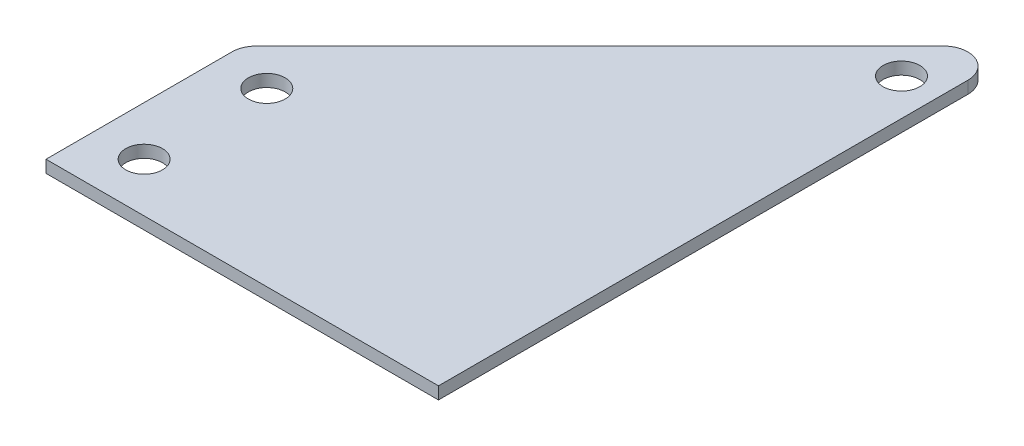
from build123d import *

# Parameters (mm, degrees)
SKETCH1_R           = 9.525
BOSS_EXTRUDE1_DEPTH = 6.35


with BuildPart() as part:
    # Sketch1 → Boss-Extrude1 (new body)
    with BuildSketch(Plane(origin=(0, 0, 0), x_dir=(1, 0, 0), z_dir=(0, 1, 0))):
        with BuildLine():
            Line((0, 0), (0, 274.066))
            ThreePointArc((0, 274.066), (-7.839920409, 285.799270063), (-21.680256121, 283.046256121))
            Line((-21.680256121, 283.046256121), (-199.480256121, 105.246256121))
            ThreePointArc((-199.480256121, 105.246256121), (-202.233270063, 101.126079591), (-203.2, 96.266))
            Line((-203.2, 96.266), (-203.2, 0))
            Line((-203.2, 0), (0, 0))
        make_face()
        with Locations(Location((-177.8, 25.4, 0), (0, 0, 270))):
            Circle(SKETCH1_R, mode=Mode.SUBTRACT)
        with Locations(Location((-177.8, 88.9, 0), (0, 0, 270))):
            Circle(SKETCH1_R, mode=Mode.SUBTRACT)
        with Locations(Location((-19.05, 258.735743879, 0), (0, 0, 270))):
            Circle(SKETCH1_R, mode=Mode.SUBTRACT)
    extrude(amount=BOSS_EXTRUDE1_DEPTH)


solid = part.part
